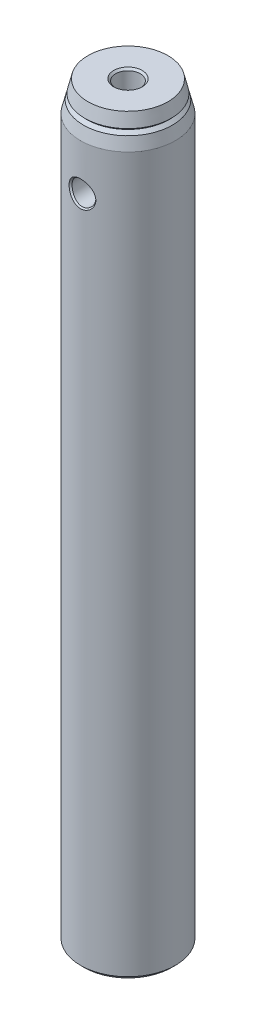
ISO-10303-21;
HEADER;
FILE_DESCRIPTION(('STEP AP214'),'2;1');
FILE_NAME('part.step','',(''),(''),'','','');
FILE_SCHEMA(('AUTOMOTIVE_DESIGN { 1 0 10303 214 1 1 1 1 }'));
ENDSEC;
DATA;
#1=APPLICATION_CONTEXT('core data for automotive mechanical design processes');
#2=APPLICATION_PROTOCOL_DEFINITION('international standard','automotive_design',2000,#1);
#3=PRODUCT_CONTEXT('',#1,'mechanical');
#4=PRODUCT('Part','Part','',(#3));
#5=PRODUCT_RELATED_PRODUCT_CATEGORY('part','',(#4));
#6=PRODUCT_DEFINITION_FORMATION('','',#4);
#7=PRODUCT_DEFINITION_CONTEXT('part definition',#1,'design');
#8=PRODUCT_DEFINITION('design','',#6,#7);
#9=PRODUCT_DEFINITION_SHAPE('','',#8);
#10=(LENGTH_UNIT() NAMED_UNIT(*) SI_UNIT(.MILLI.,.METRE.));
#11=(NAMED_UNIT(*) PLANE_ANGLE_UNIT() SI_UNIT($,.RADIAN.));
#12=(NAMED_UNIT(*) SI_UNIT($,.STERADIAN.) SOLID_ANGLE_UNIT());
#13=UNCERTAINTY_MEASURE_WITH_UNIT(LENGTH_MEASURE(1.E-05),#10,'distance_accuracy_value','');
#14=(GEOMETRIC_REPRESENTATION_CONTEXT(3) GLOBAL_UNCERTAINTY_ASSIGNED_CONTEXT((#13)) GLOBAL_UNIT_ASSIGNED_CONTEXT((#10,
#11,#12)) REPRESENTATION_CONTEXT('',''));
#15=CARTESIAN_POINT('',(0.,0.,0.));
#16=DIRECTION('',(0.,0.,1.));
#17=DIRECTION('',(1.,0.,0.));
#18=AXIS2_PLACEMENT_3D('',#15,#16,#17);
#19=CARTESIAN_POINT('',(0.,99.9998,0.));
#20=DIRECTION('',(0.,-1.,0.));
#21=DIRECTION('',(0.,0.,-1.));
#22=AXIS2_PLACEMENT_3D('',#19,#20,#21);
#23=PLANE('',#22);
#24=CARTESIAN_POINT('',(0.,99.9998,0.));
#25=DIRECTION('',(0.,-1.,0.));
#26=DIRECTION('',(0.,0.,-1.));
#27=AXIS2_PLACEMENT_3D('',#24,#25,#26);
#28=CIRCLE('',#27,1.904);
#29=CARTESIAN_POINT('',(0.,99.9998,-1.904));
#30=VERTEX_POINT('',#29);
#31=EDGE_CURVE('E11',#30,#30,#28,.T.);
#32=ORIENTED_EDGE('',*,*,#31,.T.);
#33=EDGE_LOOP('',(#32));
#34=FACE_BOUND('',#33,.T.);
#35=CARTESIAN_POINT('',(0.,99.9998,0.));
#36=DIRECTION('',(0.,1.,0.));
#37=DIRECTION('',(0.,0.,1.));
#38=AXIS2_PLACEMENT_3D('',#35,#36,#37);
#39=CIRCLE('',#38,5.34669999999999);
#40=CARTESIAN_POINT('',(0.,99.9998,5.34669999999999));
#41=VERTEX_POINT('',#40);
#42=EDGE_CURVE('E64',#41,#41,#39,.T.);
#43=ORIENTED_EDGE('',*,*,#42,.T.);
#44=EDGE_LOOP('',(#43));
#45=FACE_BOUND('',#44,.T.);
#46=ADVANCED_FACE('F17',(#34,#45),#23,.F.);
#47=CARTESIAN_POINT('',(0.,98.2894909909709,0.));
#48=DIRECTION('',(0.,-1.,0.));
#49=DIRECTION('',(0.,0.,-1.));
#50=AXIS2_PLACEMENT_3D('',#47,#48,#49);
#51=CONICAL_SURFACE('',#50,5.76886488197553,0.241998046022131);
#52=ORIENTED_EDGE('',*,*,#42,.F.);
#53=EDGE_LOOP('',(#52));
#54=FACE_BOUND('',#53,.T.);
#55=CARTESIAN_POINT('',(0.,98.2894909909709,0.));
#56=DIRECTION('',(0.,1.,0.));
#57=DIRECTION('',(0.,0.,1.));
#58=AXIS2_PLACEMENT_3D('',#55,#56,#57);
#59=CIRCLE('',#58,5.76886488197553);
#60=CARTESIAN_POINT('',(0.,98.2894909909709,5.76886488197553));
#61=VERTEX_POINT('',#60);
#62=EDGE_CURVE('E61',#61,#61,#59,.T.);
#63=ORIENTED_EDGE('',*,*,#62,.T.);
#64=EDGE_LOOP('',(#63));
#65=FACE_BOUND('',#64,.T.);
#66=ADVANCED_FACE('F216',(#54,#65),#51,.T.);
#67=CARTESIAN_POINT('',(0.,98.00082,0.));
#68=DIRECTION('',(0.,1.,0.));
#69=DIRECTION('',(0.,0.,1.));
#70=AXIS2_PLACEMENT_3D('',#67,#68,#69);
#71=CONICAL_SURFACE('',#70,5.49909999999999,0.751555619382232);
#72=ORIENTED_EDGE('',*,*,#62,.F.);
#73=EDGE_LOOP('',(#72));
#74=FACE_BOUND('',#73,.T.);
#75=CARTESIAN_POINT('',(0.,98.00082,0.));
#76=DIRECTION('',(0.,1.,0.));
#77=DIRECTION('',(0.,0.,1.));
#78=AXIS2_PLACEMENT_3D('',#75,#76,#77);
#79=CIRCLE('',#78,5.49909999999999);
#80=CARTESIAN_POINT('',(0.,98.00082,5.49909999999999));
#81=VERTEX_POINT('',#80);
#82=EDGE_CURVE('E58',#81,#81,#79,.T.);
#83=ORIENTED_EDGE('',*,*,#82,.T.);
#84=EDGE_LOOP('',(#83));
#85=FACE_BOUND('',#84,.T.);
#86=ADVANCED_FACE('F223',(#74,#85),#71,.T.);
#87=CARTESIAN_POINT('',(0.,97.5865839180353,0.));
#88=DIRECTION('',(0.,-1.,0.));
#89=DIRECTION('',(0.,0.,-1.));
#90=AXIS2_PLACEMENT_3D('',#87,#88,#89);
#91=CONICAL_SURFACE('',#90,5.94236726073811,0.819240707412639);
#92=ORIENTED_EDGE('',*,*,#82,.F.);
#93=EDGE_LOOP('',(#92));
#94=FACE_BOUND('',#93,.T.);
#95=CARTESIAN_POINT('',(0.,97.5865839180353,0.));
#96=DIRECTION('',(0.,1.,0.));
#97=DIRECTION('',(0.,0.,1.));
#98=AXIS2_PLACEMENT_3D('',#95,#96,#97);
#99=CIRCLE('',#98,5.94236726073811);
#100=CARTESIAN_POINT('',(0.,97.5865839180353,5.94236726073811));
#101=VERTEX_POINT('',#100);
#102=EDGE_CURVE('E55',#101,#101,#99,.T.);
#103=ORIENTED_EDGE('',*,*,#102,.T.);
#104=EDGE_LOOP('',(#103));
#105=FACE_BOUND('',#104,.T.);
#106=ADVANCED_FACE('F232',(#94,#105),#91,.T.);
#107=CARTESIAN_POINT('',(0.,95.9866,0.));
#108=DIRECTION('',(0.,-1.,0.));
#109=DIRECTION('',(0.,0.,-1.));
#110=AXIS2_PLACEMENT_3D('',#107,#108,#109);
#111=CONICAL_SURFACE('',#110,6.33729999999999,0.241998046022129);
#112=ORIENTED_EDGE('',*,*,#102,.F.);
#113=EDGE_LOOP('',(#112));
#114=FACE_BOUND('',#113,.T.);
#115=CARTESIAN_POINT('',(0.,95.9866,0.));
#116=DIRECTION('',(0.,1.,0.));
#117=DIRECTION('',(0.,0.,1.));
#118=AXIS2_PLACEMENT_3D('',#115,#116,#117);
#119=CIRCLE('',#118,6.33729999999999);
#120=CARTESIAN_POINT('',(0.,95.9866,6.33729999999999));
#121=VERTEX_POINT('',#120);
#122=EDGE_CURVE('E52',#121,#121,#119,.T.);
#123=ORIENTED_EDGE('',*,*,#122,.T.);
#124=EDGE_LOOP('',(#123));
#125=FACE_BOUND('',#124,.T.);
#126=ADVANCED_FACE('F89',(#114,#125),#111,.T.);
#127=CARTESIAN_POINT('',(0.,99.9998,0.));
#128=DIRECTION('',(0.,1.,0.));
#129=DIRECTION('',(0.,0.,1.));
#130=AXIS2_PLACEMENT_3D('',#127,#128,#129);
#131=CYLINDRICAL_SURFACE('',#130,6.33729999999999);
#132=CARTESIAN_POINT('',(0.,88.1117517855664,6.3373));
#133=CARTESIAN_POINT('',(0.0294399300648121,88.1117358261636,6.33730404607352));
#134=CARTESIAN_POINT('',(0.0588789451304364,88.1124541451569,6.33707764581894));
#135=CARTESIAN_POINT('',(0.117621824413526,88.1153349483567,6.33618719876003));
#136=CARTESIAN_POINT('',(0.146925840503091,88.1174945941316,6.33552401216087));
#137=CARTESIAN_POINT('',(0.205337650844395,88.1232294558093,6.33378438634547));
#138=CARTESIAN_POINT('',(0.234445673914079,88.1268025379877,6.33270857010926));
#139=CARTESIAN_POINT('',(0.292405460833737,88.1353350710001,6.33016829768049));
#140=CARTESIAN_POINT('',(0.321257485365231,88.1402928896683,6.32870429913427));
#141=CARTESIAN_POINT('',(0.378645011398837,88.1515661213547,6.32541212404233));
#142=CARTESIAN_POINT('',(0.407180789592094,88.1578802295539,6.32358429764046));
#143=CARTESIAN_POINT('',(0.463875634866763,88.1718373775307,6.31958889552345));
#144=CARTESIAN_POINT('',(0.492034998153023,88.1794792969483,6.31742160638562));
#145=CARTESIAN_POINT('',(0.547916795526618,88.1960635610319,6.31277166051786));
#146=CARTESIAN_POINT('',(0.575639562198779,88.2050048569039,6.31028925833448));
#147=CARTESIAN_POINT('',(0.630587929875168,88.2241594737,6.30503343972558));
#148=CARTESIAN_POINT('',(0.657813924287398,88.2343717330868,6.30226026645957));
#149=CARTESIAN_POINT('',(0.711708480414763,88.2560399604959,6.29644724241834));
#150=CARTESIAN_POINT('',(0.738377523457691,88.2674947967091,6.29340763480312));
#151=CARTESIAN_POINT('',(0.7910978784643,88.2916199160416,6.2870860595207));
#152=CARTESIAN_POINT('',(0.817149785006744,88.3042889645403,6.28380433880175));
#153=CARTESIAN_POINT('',(0.868575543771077,88.3308142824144,6.27702288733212));
#154=CARTESIAN_POINT('',(0.893950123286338,88.3446692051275,6.27352340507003));
#155=CARTESIAN_POINT('',(0.943960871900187,88.3735380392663,6.26633065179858));
#156=CARTESIAN_POINT('',(0.968597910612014,88.3885505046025,6.26263762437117));
#157=CARTESIAN_POINT('',(1.01707325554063,88.4197062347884,6.25508249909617));
#158=CARTESIAN_POINT('',(1.04091256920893,88.4358479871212,6.25122062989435));
#159=CARTESIAN_POINT('',(1.08773198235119,88.4692338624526,6.24335072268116));
#160=CARTESIAN_POINT('',(1.11071320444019,88.4864764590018,6.23934289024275));
#161=CARTESIAN_POINT('',(1.15575658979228,88.5220363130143,6.23121076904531));
#162=CARTESIAN_POINT('',(1.17781994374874,88.5403520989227,6.22708664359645));
#163=CARTESIAN_POINT('',(1.22096551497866,88.5780276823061,6.2187263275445));
#164=CARTESIAN_POINT('',(1.24204891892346,88.5973861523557,6.21449028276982));
#165=CARTESIAN_POINT('',(1.28317150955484,88.6371178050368,6.20600685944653));
#166=CARTESIAN_POINT('',(1.30321223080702,88.6574894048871,6.20175950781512));
#167=CARTESIAN_POINT('',(1.34221596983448,88.6991882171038,6.19335716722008));
#168=CARTESIAN_POINT('',(1.36118083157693,88.7205136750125,6.18920202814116));
#169=CARTESIAN_POINT('',(1.39800144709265,88.7640588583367,6.18099132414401));
#170=CARTESIAN_POINT('',(1.41585895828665,88.7862770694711,6.17693560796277));
#171=CARTESIAN_POINT('',(1.45043566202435,88.8315493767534,6.16895620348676));
#172=CARTESIAN_POINT('',(1.46715657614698,88.854602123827,6.16503232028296));
#173=CARTESIAN_POINT('',(1.49943021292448,88.901484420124,6.15734229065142));
#174=CARTESIAN_POINT('',(1.51498466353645,88.925312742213,6.15357591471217));
#175=CARTESIAN_POINT('',(1.54489561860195,88.9736873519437,6.14622841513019));
#176=CARTESIAN_POINT('',(1.55925388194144,88.9982325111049,6.14264702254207));
#177=CARTESIAN_POINT('',(1.58674263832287,89.0479819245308,6.13569652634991));
#178=CARTESIAN_POINT('',(1.59987492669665,89.0731851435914,6.13232711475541));
#179=CARTESIAN_POINT('',(1.62488191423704,89.1241918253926,6.12582774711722));
#180=CARTESIAN_POINT('',(1.6367584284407,89.1499943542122,6.12269744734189));
#181=CARTESIAN_POINT('',(1.65922406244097,89.2021407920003,6.11670343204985));
#182=CARTESIAN_POINT('',(1.66981497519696,89.228483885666,6.1138393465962));
#183=CARTESIAN_POINT('',(1.6896796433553,89.2816525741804,6.10840488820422));
#184=CARTESIAN_POINT('',(1.69895509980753,89.3084774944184,6.10583413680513));
#185=CARTESIAN_POINT('',(1.71615916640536,89.3625509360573,6.10101345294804));
#186=CARTESIAN_POINT('',(1.72408928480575,89.3897989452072,6.09876316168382));
#187=CARTESIAN_POINT('',(1.73857307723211,89.4446596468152,6.09461047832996));
#188=CARTESIAN_POINT('',(1.74512793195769,89.4722720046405,6.0927077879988));
#189=CARTESIAN_POINT('',(1.75683178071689,89.527802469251,6.08927733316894));
#190=CARTESIAN_POINT('',(1.76198145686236,89.5557204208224,6.08774938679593));
#191=CARTESIAN_POINT('',(1.77084554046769,89.6118031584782,6.08509542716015));
#192=CARTESIAN_POINT('',(1.77455992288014,89.6399679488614,6.0839694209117));
#193=CARTESIAN_POINT('',(1.78052484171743,89.6964854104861,6.0821461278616));
#194=CARTESIAN_POINT('',(1.78277440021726,89.7248381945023,6.08144912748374));
#195=CARTESIAN_POINT('',(1.78577903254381,89.7816729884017,6.08051108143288));
#196=CARTESIAN_POINT('',(1.78653189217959,89.8101551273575,6.08027071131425));
#197=CARTESIAN_POINT('',(1.78652142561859,89.8671195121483,6.08027101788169));
#198=CARTESIAN_POINT('',(1.78575806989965,89.8956017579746,6.0805117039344));
#199=CARTESIAN_POINT('',(1.78274505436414,89.9524377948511,6.08144750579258));
#200=CARTESIAN_POINT('',(1.78049756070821,89.9807917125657,6.08214195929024));
#201=CARTESIAN_POINT('',(1.77454464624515,90.0373128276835,6.08395846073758));
#202=CARTESIAN_POINT('',(1.77084019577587,90.0654801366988,6.08508022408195));
#203=CARTESIAN_POINT('',(1.76200373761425,90.1215697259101,6.08772409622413));
#204=CARTESIAN_POINT('',(1.75687176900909,90.1494920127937,6.08924619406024));
#205=CARTESIAN_POINT('',(1.74520976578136,90.2050333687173,6.0926637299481));
#206=CARTESIAN_POINT('',(1.73867907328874,90.2326522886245,6.09455934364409));
#207=CARTESIAN_POINT('',(1.72424904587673,90.287528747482,6.09869695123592));
#208=CARTESIAN_POINT('',(1.71634855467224,90.3147859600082,6.10093923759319));
#209=CARTESIAN_POINT('',(1.69920811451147,90.3688808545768,6.10574330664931));
#210=CARTESIAN_POINT('',(1.68996667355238,90.3957180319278,6.10830544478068));
#211=CARTESIAN_POINT('',(1.67017337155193,90.4489146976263,6.11372238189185));
#212=CARTESIAN_POINT('',(1.65961981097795,90.4752735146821,6.1165775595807));
#213=CARTESIAN_POINT('',(1.63723117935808,90.5274552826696,6.12255377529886));
#214=CARTESIAN_POINT('',(1.62539429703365,90.5532774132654,6.12567518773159));
#215=CARTESIAN_POINT('',(1.60046784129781,90.6043276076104,6.13215710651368));
#216=CARTESIAN_POINT('',(1.58737641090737,90.6295547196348,6.13551796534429));
#217=CARTESIAN_POINT('',(1.55996960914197,90.6793566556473,6.14245199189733));
#218=CARTESIAN_POINT('',(1.54565237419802,90.7039304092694,6.14602548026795));
#219=CARTESIAN_POINT('',(1.51582269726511,90.7523673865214,6.15335811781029));
#220=CARTESIAN_POINT('',(1.50030840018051,90.7762294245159,6.15711755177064));
#221=CARTESIAN_POINT('',(1.46811324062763,90.8231847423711,6.16479495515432));
#222=CARTESIAN_POINT('',(1.45143052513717,90.8462767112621,6.1687131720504));
#223=CARTESIAN_POINT('',(1.41692747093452,90.8916336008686,6.17668281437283));
#224=CARTESIAN_POINT('',(1.39910525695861,90.913897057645,6.18073445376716));
#225=CARTESIAN_POINT('',(1.36235107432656,90.9575389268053,6.18893888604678));
#226=CARTESIAN_POINT('',(1.34341716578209,90.9789156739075,6.19309184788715));
#227=CARTESIAN_POINT('',(1.30447161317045,91.0207251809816,6.20149204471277));
#228=CARTESIAN_POINT('',(1.28445791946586,91.0411559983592,6.20573944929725));
#229=CARTESIAN_POINT('',(1.2433825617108,91.0810058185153,6.21422472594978));
#230=CARTESIAN_POINT('',(1.22231929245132,91.100423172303,6.21846257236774));
#231=CARTESIAN_POINT('',(1.17920582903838,91.1382077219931,6.22682733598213));
#232=CARTESIAN_POINT('',(1.15715450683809,91.1565736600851,6.23095411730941));
#233=CARTESIAN_POINT('',(1.11212941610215,91.1922272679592,6.23909234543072));
#234=CARTESIAN_POINT('',(1.08915449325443,91.2095135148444,6.2431036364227));
#235=CARTESIAN_POINT('',(1.04234247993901,91.2429804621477,6.25098116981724));
#236=CARTESIAN_POINT('',(1.01850428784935,91.2591596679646,6.25484721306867));
#237=CARTESIAN_POINT('',(0.970027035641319,91.2903849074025,6.26241131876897));
#238=CARTESIAN_POINT('',(0.945386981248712,91.3054294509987,6.26610915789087));
#239=CARTESIAN_POINT('',(0.895366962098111,91.3343577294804,6.27331208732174));
#240=CARTESIAN_POINT('',(0.869986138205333,91.3482400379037,6.27681693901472));
#241=CARTESIAN_POINT('',(0.818545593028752,91.374816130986,6.28360960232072));
#242=CARTESIAN_POINT('',(0.792485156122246,91.3875085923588,6.2868971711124));
#243=CARTESIAN_POINT('',(0.73974637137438,91.4116772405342,6.29323083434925));
#244=CARTESIAN_POINT('',(0.713067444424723,91.4231522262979,6.29627668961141));
#245=CARTESIAN_POINT('',(0.659152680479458,91.4448581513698,6.30210251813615));
#246=CARTESIAN_POINT('',(0.631916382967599,91.4550880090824,6.30488225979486));
#247=CARTESIAN_POINT('',(0.576947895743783,91.4742759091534,6.31015143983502));
#248=CARTESIAN_POINT('',(0.549215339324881,91.4832329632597,6.31264065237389));
#249=CARTESIAN_POINT('',(0.493315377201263,91.4998475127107,6.31730435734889));
#250=CARTESIAN_POINT('',(0.465147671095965,91.5075040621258,6.31947862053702));
#251=CARTESIAN_POINT('',(0.408438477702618,91.5214899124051,6.32348801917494));
#252=CARTESIAN_POINT('',(0.379896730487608,91.5278182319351,6.32532290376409));
#253=CARTESIAN_POINT('',(0.322500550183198,91.5391200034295,6.32862915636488));
#254=CARTESIAN_POINT('',(0.293645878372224,91.5440923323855,6.33010022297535));
#255=CARTESIAN_POINT('',(0.235684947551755,91.5526546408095,6.33265448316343));
#256=CARTESIAN_POINT('',(0.206578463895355,91.5562432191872,6.33373728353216));
#257=CARTESIAN_POINT('',(0.148175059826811,91.5620105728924,6.33549068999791));
#258=CARTESIAN_POINT('',(0.118877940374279,91.5641875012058,6.33616075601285));
#259=CARTESIAN_POINT('',(0.0601542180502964,91.5671046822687,6.33706445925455));
#260=CARTESIAN_POINT('',(0.0307274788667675,91.5678424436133,6.33729733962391));
#261=CARTESIAN_POINT('',(-0.0281314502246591,91.5678530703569,6.33730239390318));
#262=CARTESIAN_POINT('',(-0.0575636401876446,91.5671256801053,6.33707448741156));
#263=CARTESIAN_POINT('',(-0.116308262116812,91.564227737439,6.33618067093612));
#264=CARTESIAN_POINT('',(-0.145620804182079,91.5620592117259,6.33551537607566));
#265=CARTESIAN_POINT('',(-0.204063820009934,91.5563082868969,6.33377147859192));
#266=CARTESIAN_POINT('',(-0.233194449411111,91.5527273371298,6.33269329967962));
#267=CARTESIAN_POINT('',(-0.291211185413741,91.5441801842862,6.33014820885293));
#268=CARTESIAN_POINT('',(-0.320097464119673,91.5392150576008,6.32868159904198));
#269=CARTESIAN_POINT('',(-0.377563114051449,91.5279280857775,6.32538416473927));
#270=CARTESIAN_POINT('',(-0.406142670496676,91.5216071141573,6.32355357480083));
#271=CARTESIAN_POINT('',(-0.462932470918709,91.5076367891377,6.31955264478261));
#272=CARTESIAN_POINT('',(-0.491142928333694,91.499988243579,6.31738251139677));
#273=CARTESIAN_POINT('',(-0.547132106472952,91.4833909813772,6.31272692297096));
#274=CARTESIAN_POINT('',(-0.574911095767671,91.4744431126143,6.31024167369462));
#275=CARTESIAN_POINT('',(-0.629974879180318,91.4552753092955,6.30498025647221));
#276=CARTESIAN_POINT('',(-0.657260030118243,91.4450563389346,6.30220430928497));
#277=CARTESIAN_POINT('',(-0.711273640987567,91.4233743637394,6.29638588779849));
#278=CARTESIAN_POINT('',(-0.738002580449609,91.41191248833,6.29334365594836));
#279=CARTESIAN_POINT('',(-0.790841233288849,91.3877726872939,6.28701704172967));
#280=CARTESIAN_POINT('',(-0.816951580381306,91.3750960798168,6.28373292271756));
#281=CARTESIAN_POINT('',(-0.8684904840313,91.348554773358,6.2769469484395));
#282=CARTESIAN_POINT('',(-0.893919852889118,91.3346915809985,6.27344537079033));
#283=CARTESIAN_POINT('',(-0.944034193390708,91.3058050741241,6.26624876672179));
#284=CARTESIAN_POINT('',(-0.968720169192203,91.2907834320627,6.26255402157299));
#285=CARTESIAN_POINT('',(-1.0172851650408,91.2596079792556,6.2549958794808));
#286=CARTESIAN_POINT('',(-1.04116537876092,91.243455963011,6.25113275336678));
#287=CARTESIAN_POINT('',(-1.08805606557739,91.2100479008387,6.24326080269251));
#288=CARTESIAN_POINT('',(-1.11106789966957,91.1927937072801,6.23925222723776));
#289=CARTESIAN_POINT('',(-1.15615992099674,91.1572089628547,6.23111925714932));
#290=CARTESIAN_POINT('',(-1.17824158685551,91.138880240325,6.2269950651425));
#291=CARTESIAN_POINT('',(-1.22140823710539,91.1011761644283,6.21863501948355));
#292=CARTESIAN_POINT('',(-1.2424947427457,91.081802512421,6.21439935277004));
#293=CARTESIAN_POINT('',(-1.28361269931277,91.0420361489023,6.2059174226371));
#294=CARTESIAN_POINT('',(-1.30364583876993,91.0216451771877,6.20167118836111));
#295=CARTESIAN_POINT('',(-1.34263154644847,90.9799033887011,6.193271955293));
#296=CARTESIAN_POINT('',(-1.3615858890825,90.9585542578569,6.18911881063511));
#297=CARTESIAN_POINT('',(-1.39838257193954,90.9149579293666,6.18091254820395));
#298=CARTESIAN_POINT('',(-1.41622659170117,90.8927121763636,6.17685928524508));
#299=CARTESIAN_POINT('',(-1.4507743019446,90.8473822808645,6.16888519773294));
#300=CARTESIAN_POINT('',(-1.46747963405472,90.8242994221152,6.16496418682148));
#301=CARTESIAN_POINT('',(-1.49972072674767,90.7773554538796,6.15728016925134));
#302=CARTESIAN_POINT('',(-1.51525814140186,90.7534955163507,6.15351694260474));
#303=CARTESIAN_POINT('',(-1.54513433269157,90.7050573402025,6.14617589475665));
#304=CARTESIAN_POINT('',(-1.55947480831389,90.6804801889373,6.14259781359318));
#305=CARTESIAN_POINT('',(-1.58692795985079,90.6306675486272,6.13565397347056));
#306=CARTESIAN_POINT('',(-1.60004239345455,90.6054330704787,6.13228791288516));
#307=CARTESIAN_POINT('',(-1.62501430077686,90.5543657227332,6.12579516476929));
#308=CARTESIAN_POINT('',(-1.63687358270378,90.5285337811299,6.12266813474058));
#309=CARTESIAN_POINT('',(-1.65930603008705,90.4763314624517,6.11668046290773));
#310=CARTESIAN_POINT('',(-1.66988102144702,90.4499619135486,6.11381944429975));
#311=CARTESIAN_POINT('',(-1.68971576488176,90.3967443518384,6.10839081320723));
#312=CARTESIAN_POINT('',(-1.69897730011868,90.3698970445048,6.10582280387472));
#313=CARTESIAN_POINT('',(-1.71615607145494,90.3157839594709,6.10100719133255));
#314=CARTESIAN_POINT('',(-1.72407495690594,90.2885187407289,6.09875919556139));
#315=CARTESIAN_POINT('',(-1.73853945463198,90.2336298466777,6.09461058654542));
#316=CARTESIAN_POINT('',(-1.7450864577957,90.2060065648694,6.09270962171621));
#317=CARTESIAN_POINT('',(-1.75677836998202,90.1504615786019,6.08928200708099));
#318=CARTESIAN_POINT('',(-1.76192425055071,90.1225400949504,6.08775509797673));
#319=CARTESIAN_POINT('',(-1.77078516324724,90.0664587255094,6.08510249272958));
#320=CARTESIAN_POINT('',(-1.7745005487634,90.0382989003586,6.08397669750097));
#321=CARTESIAN_POINT('',(-1.78047228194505,89.9818009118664,6.08215307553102));
#322=CARTESIAN_POINT('',(-1.78272812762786,89.9534626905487,6.0814553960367));
#323=CARTESIAN_POINT('',(-1.78575147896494,89.8966676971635,6.08051493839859));
#324=CARTESIAN_POINT('',(-1.78651735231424,89.8682108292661,6.08027265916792));
#325=CARTESIAN_POINT('',(-1.7865367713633,89.811302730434,6.0802688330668));
#326=CARTESIAN_POINT('',(-1.78579064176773,89.7828514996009,6.08050718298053));
#327=CARTESIAN_POINT('',(-1.78281302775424,89.7260777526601,6.08143863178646));
#328=CARTESIAN_POINT('',(-1.78058377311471,89.6977551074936,6.08213104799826));
#329=CARTESIAN_POINT('',(-1.77466841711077,89.6412967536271,6.08394357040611));
#330=CARTESIAN_POINT('',(-1.77098334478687,89.6131609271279,6.08506337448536));
#331=CARTESIAN_POINT('',(-1.76218590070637,89.5571344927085,6.08770347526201));
#332=CARTESIAN_POINT('',(-1.75707361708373,89.529243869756,6.08922374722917));
#333=CARTESIAN_POINT('',(-1.74545068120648,89.4737659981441,6.09263775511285));
#334=CARTESIAN_POINT('',(-1.73893940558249,89.4461788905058,6.09453165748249));
#335=CARTESIAN_POINT('',(-1.72454728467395,89.3913661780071,6.09866596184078));
#336=CARTESIAN_POINT('',(-1.71666529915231,89.3641408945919,6.10090665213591));
#337=CARTESIAN_POINT('',(-1.69956034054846,89.310109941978,6.10570763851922));
#338=CARTESIAN_POINT('',(-1.69033586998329,89.2833047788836,6.1082682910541));
#339=CARTESIAN_POINT('',(-1.67057437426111,89.2301721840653,6.11368235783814));
#340=CARTESIAN_POINT('',(-1.66003562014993,89.2038454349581,6.11653615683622));
#341=CARTESIAN_POINT('',(-1.63767386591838,89.1517278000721,6.1225097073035));
#342=CARTESIAN_POINT('',(-1.62584899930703,89.1259377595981,6.12562984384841));
#343=CARTESIAN_POINT('',(-1.60094323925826,89.0749516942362,6.13210929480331));
#344=CARTESIAN_POINT('',(-1.58786040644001,89.0497566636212,6.13546897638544));
#345=CARTESIAN_POINT('',(-1.56046686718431,89.000018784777,6.1424007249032));
#346=CARTESIAN_POINT('',(-1.54615418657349,88.9754770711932,6.14597313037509));
#347=CARTESIAN_POINT('',(-1.5163290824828,88.927104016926,6.15330367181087));
#348=CARTESIAN_POINT('',(-1.500814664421,88.9032739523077,6.15706211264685));
#349=CARTESIAN_POINT('',(-1.46861415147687,88.8563823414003,6.16473759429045));
#350=CARTESIAN_POINT('',(-1.4519260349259,88.8333222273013,6.16865490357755));
#351=CARTESIAN_POINT('',(-1.4174063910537,88.7880288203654,6.17662278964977));
#352=CARTESIAN_POINT('',(-1.39957279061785,88.7657971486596,6.18067360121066));
#353=CARTESIAN_POINT('',(-1.3627897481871,88.7222182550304,6.18887643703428));
#354=CARTESIAN_POINT('',(-1.34383814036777,88.700872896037,6.19302864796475));
#355=CARTESIAN_POINT('',(-1.30484939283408,88.6591266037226,6.20142739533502));
#356=CARTESIAN_POINT('',(-1.28480994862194,88.6387278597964,6.20567411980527));
#357=CARTESIAN_POINT('',(-1.24367802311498,88.5989375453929,6.21415825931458));
#358=CARTESIAN_POINT('',(-1.22258362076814,88.5795479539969,6.21839564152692));
#359=CARTESIAN_POINT('',(-1.17940611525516,88.5418093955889,6.22675999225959));
#360=CARTESIAN_POINT('',(-1.15732157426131,88.5234620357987,6.23088678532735));
#361=CARTESIAN_POINT('',(-1.11222765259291,88.4878380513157,6.23902550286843));
#362=CARTESIAN_POINT('',(-1.08921687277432,88.4705631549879,6.24303723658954));
#363=CARTESIAN_POINT('',(-1.0423315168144,88.4371119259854,6.25091606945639));
#364=CARTESIAN_POINT('',(-1.01845565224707,88.4209373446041,6.25478293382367));
#365=CARTESIAN_POINT('',(-0.969901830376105,88.3897153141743,6.26234904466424));
#366=CARTESIAN_POINT('',(-0.945222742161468,88.3746695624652,6.26604803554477));
#367=CARTESIAN_POINT('',(-0.895123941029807,88.3457336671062,6.27325357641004));
#368=CARTESIAN_POINT('',(-0.869703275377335,88.3318451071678,6.27675986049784));
#369=CARTESIAN_POINT('',(-0.818182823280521,88.3052521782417,6.28355564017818));
#370=CARTESIAN_POINT('',(-0.792082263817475,88.2925492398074,6.286844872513));
#371=CARTESIAN_POINT('',(-0.739263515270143,88.2683561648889,6.29318205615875));
#372=CARTESIAN_POINT('',(-0.712544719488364,88.2568672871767,6.29622975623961));
#373=CARTESIAN_POINT('',(-0.658551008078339,88.2351309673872,6.30205940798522));
#374=CARTESIAN_POINT('',(-0.631275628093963,88.2248846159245,6.30484112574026));
#375=CARTESIAN_POINT('',(-0.576230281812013,88.205661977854,6.31011433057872));
#376=CARTESIAN_POINT('',(-0.548459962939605,88.1966866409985,6.31260560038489));
#377=CARTESIAN_POINT('',(-0.492486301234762,88.1800346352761,6.31727343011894));
#378=CARTESIAN_POINT('',(-0.464282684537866,88.1723588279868,6.31944978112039));
#379=CARTESIAN_POINT('',(-0.407504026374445,88.1583344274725,6.32346330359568));
#380=CARTESIAN_POINT('',(-0.378928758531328,88.1519866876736,6.32530025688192));
#381=CARTESIAN_POINT('',(-0.321468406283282,88.1406469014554,6.32861052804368));
#382=CARTESIAN_POINT('',(-0.292583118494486,88.1356558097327,6.3300835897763));
#383=CARTESIAN_POINT('',(-0.234564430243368,88.1270576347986,6.33264167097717));
#384=CARTESIAN_POINT('',(-0.205430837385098,88.1234517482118,6.33372635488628));
#385=CARTESIAN_POINT('',(-0.146976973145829,88.1176523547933,6.335483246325));
#386=CARTESIAN_POINT('',(-0.117656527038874,88.1154604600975,6.33615498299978));
#387=CARTESIAN_POINT('',(-0.0588914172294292,88.1125165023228,6.33706186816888));
#388=CARTESIAN_POINT('',(-0.0294466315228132,88.1117666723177,6.33729633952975));
#389=CARTESIAN_POINT('',(0.,88.1117517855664,6.3373));
#390=B_SPLINE_CURVE_WITH_KNOTS('',3,(#132,#133,#134,#135,#136,#137,#138,#139,#140,#141,#142,
#143,#144,#145,#146,#147,#148,#149,#150,#151,#152,#153,#154,#155,#156,#157,#158,#159,#160,#161,
#162,#163,#164,#165,#166,#167,#168,#169,#170,#171,#172,#173,#174,#175,#176,#177,#178,#179,#180,
#181,#182,#183,#184,#185,#186,#187,#188,#189,#190,#191,#192,#193,#194,#195,#196,#197,#198,#199,
#200,#201,#202,#203,#204,#205,#206,#207,#208,#209,#210,#211,#212,#213,#214,#215,#216,#217,#218,
#219,#220,#221,#222,#223,#224,#225,#226,#227,#228,#229,#230,#231,#232,#233,#234,#235,#236,#237,
#238,#239,#240,#241,#242,#243,#244,#245,#246,#247,#248,#249,#250,#251,#252,#253,#254,#255,#256,
#257,#258,#259,#260,#261,#262,#263,#264,#265,#266,#267,#268,#269,#270,#271,#272,#273,#274,#275,
#276,#277,#278,#279,#280,#281,#282,#283,#284,#285,#286,#287,#288,#289,#290,#291,#292,#293,#294,
#295,#296,#297,#298,#299,#300,#301,#302,#303,#304,#305,#306,#307,#308,#309,#310,#311,#312,#313,
#314,#315,#316,#317,#318,#319,#320,#321,#322,#323,#324,#325,#326,#327,#328,#329,#330,#331,#332,
#333,#334,#335,#336,#337,#338,#339,#340,#341,#342,#343,#344,#345,#346,#347,#348,#349,#350,#351,
#352,#353,#354,#355,#356,#357,#358,#359,#360,#361,#362,#363,#364,#365,#366,#367,#368,#369,#370,
#371,#372,#373,#374,#375,#376,#377,#378,#379,#380,#381,#382,#383,#384,#385,#386,#387,#388,#389),
.UNSPECIFIED.,.F.,.F.,(4,2,2,2,2,2,2,2,2,2,2,2,2,2,2,2,2,2,2,2,2,2,2,2,2,2,2,2,2,2,2,2,2,2,2,2,
2,2,2,2,2,2,2,2,2,2,2,2,2,2,2,2,2,2,2,2,2,2,2,2,2,2,2,2,2,2,2,2,2,2,2,2,2,2,2,2,2,2,2,2,2,2,2,2,
2,2,2,2,2,2,2,2,2,2,2,2,2,2,2,2,2,2,2,2,2,2,2,2,2,2,2,2,2,2,2,2,2,2,2,2,2,2,2,2,2,2,2,2,4),(0.,
0.0883078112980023,0.176442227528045,0.264444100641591,0.352342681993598,0.440157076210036,
0.527897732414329,0.61556795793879,0.703165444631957,0.790683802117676,0.878114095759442,
0.965446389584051,1.05267129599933,1.13978153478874,1.22677350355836,1.31364886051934,
1.40041611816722,1.48705183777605,1.57353427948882,1.65987575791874,1.74608340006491,
1.83216070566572,1.91810912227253,2.00392963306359,2.08962435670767,2.17519815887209,
2.26066027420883,2.34602593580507,2.43131800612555,2.51656859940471,2.60182068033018,
2.68712961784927,2.77256466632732,2.85800137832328,2.94331366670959,3.02856923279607,
3.11382246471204,3.19911588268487,3.28448165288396,3.36994314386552,3.45551650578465,
3.54121225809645,3.62703687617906,3.71299437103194,3.79908785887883,3.88532111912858,
3.97170013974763,4.0582346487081,4.14493962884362,4.23178154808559,4.31872527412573,
4.40578126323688,4.49295255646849,4.58023639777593,4.66762584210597,4.75511135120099,
4.84268237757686,4.930328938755,5.01804318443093,5.10582095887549,5.19366335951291,
5.28157829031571,5.36958200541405,5.45770063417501,5.54597167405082,5.63425811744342,
5.72242066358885,5.81049297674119,5.89849699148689,5.98644447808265,6.07433863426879,
6.16217569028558,6.24994651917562,6.33763824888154,6.4252358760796,6.51272388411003,
6.60008786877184,6.68731617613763,6.77440155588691,6.86134283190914,6.94814658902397,
7.03480667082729,7.12131982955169,7.20769877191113,7.29395042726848,7.38007753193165,
7.46608022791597,7.55195767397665,7.63770966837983,7.72333828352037,7.80884951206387,
7.89425492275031,7.97957332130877,8.06483240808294,8.1500704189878,8.2353377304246,
8.32069840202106,8.40604074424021,8.49125506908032,8.5764092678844,8.66155820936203,
8.74674517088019,8.83200333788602,8.91735734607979,9.00282484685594,9.08841808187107,
9.17414545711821,9.2600131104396,9.34602646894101,9.43219179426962,9.51851771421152,
9.60501673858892,9.69170675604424,9.77856083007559,9.86554539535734,9.95266668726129,
10.039923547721,10.127309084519,10.2148123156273,10.3024197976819,10.3901172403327,
10.477891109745,10.5657302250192,10.6536273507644,10.7415807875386,10.8295959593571,
10.9176869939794,11.005878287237,11.0942060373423),.UNSPECIFIED.);
#391=CARTESIAN_POINT('',(0.,88.1117517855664,6.3373));
#392=VERTEX_POINT('',#391);
#393=EDGE_CURVE('E135',#392,#392,#390,.F.);
#394=ORIENTED_EDGE('',*,*,#393,.T.);
#395=EDGE_LOOP('',(#394));
#396=FACE_BOUND('',#395,.T.);
#397=CARTESIAN_POINT('',(0.,91.5678482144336,-6.3373));
#398=CARTESIAN_POINT('',(0.0294399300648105,91.5678641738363,-6.33730404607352));
#399=CARTESIAN_POINT('',(0.0588789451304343,91.5671458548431,-6.33707764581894));
#400=CARTESIAN_POINT('',(0.117621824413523,91.5642650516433,-6.33618719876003));
#401=CARTESIAN_POINT('',(0.146925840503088,91.5621054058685,-6.33552401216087));
#402=CARTESIAN_POINT('',(0.205337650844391,91.5563705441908,-6.33378438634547));
#403=CARTESIAN_POINT('',(0.234445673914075,91.5527974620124,-6.33270857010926));
#404=CARTESIAN_POINT('',(0.292405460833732,91.5442649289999,-6.33016829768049));
#405=CARTESIAN_POINT('',(0.321257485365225,91.5393071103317,-6.32870429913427));
#406=CARTESIAN_POINT('',(0.378645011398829,91.5280338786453,-6.32541212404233));
#407=CARTESIAN_POINT('',(0.407180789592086,91.5217197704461,-6.32358429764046));
#408=CARTESIAN_POINT('',(0.463875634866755,91.5077626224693,-6.31958889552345));
#409=CARTESIAN_POINT('',(0.492034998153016,91.5001207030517,-6.31742160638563));
#410=CARTESIAN_POINT('',(0.547916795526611,91.483536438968,-6.31277166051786));
#411=CARTESIAN_POINT('',(0.575639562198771,91.4745951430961,-6.31028925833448));
#412=CARTESIAN_POINT('',(0.63058792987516,91.4554405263,-6.30503343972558));
#413=CARTESIAN_POINT('',(0.657813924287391,91.4452282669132,-6.30226026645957));
#414=CARTESIAN_POINT('',(0.711708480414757,91.4235600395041,-6.29644724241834));
#415=CARTESIAN_POINT('',(0.738377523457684,91.4121052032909,-6.29340763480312));
#416=CARTESIAN_POINT('',(0.791097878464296,91.3879800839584,-6.2870860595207));
#417=CARTESIAN_POINT('',(0.817149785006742,91.3753110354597,-6.28380433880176));
#418=CARTESIAN_POINT('',(0.868575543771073,91.3487857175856,-6.27702288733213));
#419=CARTESIAN_POINT('',(0.89395012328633,91.3349307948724,-6.27352340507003));
#420=CARTESIAN_POINT('',(0.943960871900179,91.3060619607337,-6.26633065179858));
#421=CARTESIAN_POINT('',(0.968597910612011,91.2910494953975,-6.26263762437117));
#422=CARTESIAN_POINT('',(1.01707325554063,91.2598937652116,-6.25508249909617));
#423=CARTESIAN_POINT('',(1.04091256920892,91.2437520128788,-6.25122062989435));
#424=CARTESIAN_POINT('',(1.08773198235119,91.2103661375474,-6.24335072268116));
#425=CARTESIAN_POINT('',(1.11071320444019,91.1931235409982,-6.23934289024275));
#426=CARTESIAN_POINT('',(1.15575658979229,91.1575636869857,-6.23121076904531));
#427=CARTESIAN_POINT('',(1.17781994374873,91.1392479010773,-6.22708664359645));
#428=CARTESIAN_POINT('',(1.22096551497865,91.1015723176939,-6.2187263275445));
#429=CARTESIAN_POINT('',(1.24204891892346,91.0822138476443,-6.21449028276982));
#430=CARTESIAN_POINT('',(1.28317150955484,91.0424821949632,-6.20600685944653));
#431=CARTESIAN_POINT('',(1.30321223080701,91.0221105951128,-6.20175950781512));
#432=CARTESIAN_POINT('',(1.34221596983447,90.9804117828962,-6.19335716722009));
#433=CARTESIAN_POINT('',(1.36118083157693,90.9590863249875,-6.18920202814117));
#434=CARTESIAN_POINT('',(1.39800144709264,90.9155411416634,-6.18099132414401));
#435=CARTESIAN_POINT('',(1.41585895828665,90.8933229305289,-6.17693560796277));
#436=CARTESIAN_POINT('',(1.45043566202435,90.8480506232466,-6.16895620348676));
#437=CARTESIAN_POINT('',(1.46715657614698,90.824997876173,-6.16503232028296));
#438=CARTESIAN_POINT('',(1.49943021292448,90.778115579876,-6.15734229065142));
#439=CARTESIAN_POINT('',(1.51498466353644,90.754287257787,-6.15357591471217));
#440=CARTESIAN_POINT('',(1.54489561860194,90.7059126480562,-6.14622841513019));
#441=CARTESIAN_POINT('',(1.55925388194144,90.6813674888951,-6.14264702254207));
#442=CARTESIAN_POINT('',(1.58674263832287,90.6316180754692,-6.13569652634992));
#443=CARTESIAN_POINT('',(1.59987492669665,90.6064148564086,-6.13232711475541));
#444=CARTESIAN_POINT('',(1.62488191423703,90.5554081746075,-6.12582774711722));
#445=CARTESIAN_POINT('',(1.63675842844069,90.5296056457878,-6.1226974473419));
#446=CARTESIAN_POINT('',(1.65922406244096,90.4774592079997,-6.11670343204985));
#447=CARTESIAN_POINT('',(1.66981497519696,90.451116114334,-6.1138393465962));
#448=CARTESIAN_POINT('',(1.68967964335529,90.3979474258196,-6.10840488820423));
#449=CARTESIAN_POINT('',(1.69895509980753,90.3711225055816,-6.10583413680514));
#450=CARTESIAN_POINT('',(1.71615916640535,90.3170490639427,-6.10101345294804));
#451=CARTESIAN_POINT('',(1.72408928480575,90.2898010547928,-6.09876316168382));
#452=CARTESIAN_POINT('',(1.73857307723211,90.2349403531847,-6.09461047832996));
#453=CARTESIAN_POINT('',(1.74512793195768,90.2073279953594,-6.0927077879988));
#454=CARTESIAN_POINT('',(1.75683178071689,90.151797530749,-6.08927733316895));
#455=CARTESIAN_POINT('',(1.76198145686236,90.1238795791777,-6.08774938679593));
#456=CARTESIAN_POINT('',(1.77084554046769,90.0677968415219,-6.08509542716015));
#457=CARTESIAN_POINT('',(1.77455992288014,90.0396320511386,-6.0839694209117));
#458=CARTESIAN_POINT('',(1.78052484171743,89.9831145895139,-6.0821461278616));
#459=CARTESIAN_POINT('',(1.78277440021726,89.9547618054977,-6.08144912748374));
#460=CARTESIAN_POINT('',(1.78577903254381,89.8979270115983,-6.08051108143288));
#461=CARTESIAN_POINT('',(1.78653189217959,89.8694448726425,-6.08027071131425));
#462=CARTESIAN_POINT('',(1.78652142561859,89.8124804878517,-6.08027101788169));
#463=CARTESIAN_POINT('',(1.78575806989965,89.7839982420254,-6.0805117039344));
#464=CARTESIAN_POINT('',(1.78274505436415,89.7271622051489,-6.08144750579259));
#465=CARTESIAN_POINT('',(1.78049756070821,89.6988082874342,-6.08214195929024));
#466=CARTESIAN_POINT('',(1.77454464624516,89.6422871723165,-6.08395846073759));
#467=CARTESIAN_POINT('',(1.77084019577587,89.6141198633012,-6.08508022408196));
#468=CARTESIAN_POINT('',(1.76200373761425,89.5580302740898,-6.08772409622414));
#469=CARTESIAN_POINT('',(1.7568717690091,89.5301079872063,-6.08924619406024));
#470=CARTESIAN_POINT('',(1.74520976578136,89.4745666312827,-6.09266372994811));
#471=CARTESIAN_POINT('',(1.73867907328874,89.4469477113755,-6.0945593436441));
#472=CARTESIAN_POINT('',(1.72424904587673,89.392071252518,-6.09869695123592));
#473=CARTESIAN_POINT('',(1.71634855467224,89.3648140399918,-6.10093923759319));
#474=CARTESIAN_POINT('',(1.69920811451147,89.3107191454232,-6.10574330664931));
#475=CARTESIAN_POINT('',(1.68996667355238,89.2838819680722,-6.10830544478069));
#476=CARTESIAN_POINT('',(1.67017337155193,89.2306853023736,-6.11372238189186));
#477=CARTESIAN_POINT('',(1.65961981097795,89.2043264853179,-6.1165775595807));
#478=CARTESIAN_POINT('',(1.63723117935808,89.1521447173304,-6.12255377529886));
#479=CARTESIAN_POINT('',(1.62539429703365,89.1263225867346,-6.12567518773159));
#480=CARTESIAN_POINT('',(1.60046784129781,89.0752723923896,-6.13215710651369));
#481=CARTESIAN_POINT('',(1.58737641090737,89.0500452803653,-6.13551796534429));
#482=CARTESIAN_POINT('',(1.55996960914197,89.0002433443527,-6.14245199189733));
#483=CARTESIAN_POINT('',(1.54565237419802,88.9756695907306,-6.14602548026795));
#484=CARTESIAN_POINT('',(1.51582269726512,88.9272326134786,-6.15335811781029));
#485=CARTESIAN_POINT('',(1.50030840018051,88.903370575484,-6.15711755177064));
#486=CARTESIAN_POINT('',(1.46811324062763,88.8564152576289,-6.16479495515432));
#487=CARTESIAN_POINT('',(1.45143052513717,88.8333232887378,-6.16871317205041));
#488=CARTESIAN_POINT('',(1.41692747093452,88.7879663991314,-6.17668281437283));
#489=CARTESIAN_POINT('',(1.3991052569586,88.765702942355,-6.18073445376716));
#490=CARTESIAN_POINT('',(1.36235107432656,88.7220610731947,-6.18893888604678));
#491=CARTESIAN_POINT('',(1.34341716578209,88.7006843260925,-6.19309184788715));
#492=CARTESIAN_POINT('',(1.30447161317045,88.6588748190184,-6.20149204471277));
#493=CARTESIAN_POINT('',(1.28445791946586,88.6384440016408,-6.20573944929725));
#494=CARTESIAN_POINT('',(1.2433825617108,88.5985941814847,-6.21422472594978));
#495=CARTESIAN_POINT('',(1.22231929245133,88.579176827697,-6.21846257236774));
#496=CARTESIAN_POINT('',(1.17920582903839,88.5413922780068,-6.22682733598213));
#497=CARTESIAN_POINT('',(1.15715450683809,88.5230263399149,-6.23095411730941));
#498=CARTESIAN_POINT('',(1.11212941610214,88.4873727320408,-6.23909234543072));
#499=CARTESIAN_POINT('',(1.08915449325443,88.4700864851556,-6.2431036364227));
#500=CARTESIAN_POINT('',(1.04234247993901,88.4366195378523,-6.25098116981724));
#501=CARTESIAN_POINT('',(1.01850428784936,88.4204403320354,-6.25484721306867));
#502=CARTESIAN_POINT('',(0.970027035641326,88.3892150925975,-6.26241131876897));
#503=CARTESIAN_POINT('',(0.945386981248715,88.3741705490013,-6.26610915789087));
#504=CARTESIAN_POINT('',(0.895366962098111,88.3452422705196,-6.27331208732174));
#505=CARTESIAN_POINT('',(0.869986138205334,88.3313599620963,-6.27681693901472));
#506=CARTESIAN_POINT('',(0.818545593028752,88.304783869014,-6.28360960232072));
#507=CARTESIAN_POINT('',(0.792485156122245,88.2920914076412,-6.2868971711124));
#508=CARTESIAN_POINT('',(0.73974637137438,88.2679227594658,-6.29323083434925));
#509=CARTESIAN_POINT('',(0.713067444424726,88.256447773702,-6.29627668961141));
#510=CARTESIAN_POINT('',(0.659152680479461,88.2347418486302,-6.30210251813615));
#511=CARTESIAN_POINT('',(0.631916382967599,88.2245119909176,-6.30488225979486));
#512=CARTESIAN_POINT('',(0.576947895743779,88.2053240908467,-6.31015143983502));
#513=CARTESIAN_POINT('',(0.549215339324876,88.1963670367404,-6.31264065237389));
#514=CARTESIAN_POINT('',(0.493315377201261,88.1797524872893,-6.31730435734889));
#515=CARTESIAN_POINT('',(0.465147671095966,88.1720959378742,-6.31947862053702));
#516=CARTESIAN_POINT('',(0.40843847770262,88.1581100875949,-6.32348801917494));
#517=CARTESIAN_POINT('',(0.379896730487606,88.1517817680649,-6.32532290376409));
#518=CARTESIAN_POINT('',(0.322500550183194,88.1404799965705,-6.32862915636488));
#519=CARTESIAN_POINT('',(0.29364587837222,88.1355076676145,-6.33010022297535));
#520=CARTESIAN_POINT('',(0.235684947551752,88.1269453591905,-6.33265448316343));
#521=CARTESIAN_POINT('',(0.206578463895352,88.1233567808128,-6.33373728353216));
#522=CARTESIAN_POINT('',(0.148175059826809,88.1175894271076,-6.33549068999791));
#523=CARTESIAN_POINT('',(0.118877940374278,88.1154124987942,-6.33616075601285));
#524=CARTESIAN_POINT('',(0.060154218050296,88.1124953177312,-6.33706445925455));
#525=CARTESIAN_POINT('',(0.030727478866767,88.1117575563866,-6.33729733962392));
#526=CARTESIAN_POINT('',(-0.0281314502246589,88.1117469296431,-6.33730239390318));
#527=CARTESIAN_POINT('',(-0.0575636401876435,88.1124743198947,-6.33707448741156));
#528=CARTESIAN_POINT('',(-0.116308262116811,88.115372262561,-6.33618067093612));
#529=CARTESIAN_POINT('',(-0.145620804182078,88.1175407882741,-6.33551537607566));
#530=CARTESIAN_POINT('',(-0.204063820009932,88.1232917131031,-6.33377147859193));
#531=CARTESIAN_POINT('',(-0.233194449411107,88.1268726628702,-6.33269329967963));
#532=CARTESIAN_POINT('',(-0.291211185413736,88.1354198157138,-6.33014820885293));
#533=CARTESIAN_POINT('',(-0.320097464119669,88.1403849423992,-6.32868159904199));
#534=CARTESIAN_POINT('',(-0.377563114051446,88.1516719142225,-6.32538416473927));
#535=CARTESIAN_POINT('',(-0.406142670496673,88.1579928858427,-6.32355357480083));
#536=CARTESIAN_POINT('',(-0.462932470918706,88.1719632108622,-6.31955264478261));
#537=CARTESIAN_POINT('',(-0.491142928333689,88.179611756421,-6.31738251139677));
#538=CARTESIAN_POINT('',(-0.547132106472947,88.1962090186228,-6.31272692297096));
#539=CARTESIAN_POINT('',(-0.574911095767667,88.2051568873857,-6.31024167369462));
#540=CARTESIAN_POINT('',(-0.629974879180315,88.2243246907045,-6.30498025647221));
#541=CARTESIAN_POINT('',(-0.657260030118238,88.2345436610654,-6.30220430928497));
#542=CARTESIAN_POINT('',(-0.71127364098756,88.2562256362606,-6.29638588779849));
#543=CARTESIAN_POINT('',(-0.738002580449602,88.26768751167,-6.29334365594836));
#544=CARTESIAN_POINT('',(-0.790841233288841,88.2918273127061,-6.28701704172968));
#545=CARTESIAN_POINT('',(-0.816951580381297,88.3045039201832,-6.28373292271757));
#546=CARTESIAN_POINT('',(-0.868490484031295,88.331045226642,-6.2769469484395));
#547=CARTESIAN_POINT('',(-0.893919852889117,88.3449084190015,-6.27344537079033));
#548=CARTESIAN_POINT('',(-0.944034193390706,88.3737949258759,-6.2662487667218));
#549=CARTESIAN_POINT('',(-0.968720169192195,88.3888165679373,-6.262554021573));
#550=CARTESIAN_POINT('',(-1.01728516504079,88.4199920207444,-6.2549958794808));
#551=CARTESIAN_POINT('',(-1.04116537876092,88.436144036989,-6.25113275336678));
#552=CARTESIAN_POINT('',(-1.08805606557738,88.4695520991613,-6.24326080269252));
#553=CARTESIAN_POINT('',(-1.11106789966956,88.4868062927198,-6.23925222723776));
#554=CARTESIAN_POINT('',(-1.15615992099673,88.5223910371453,-6.23111925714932));
#555=CARTESIAN_POINT('',(-1.17824158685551,88.540719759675,-6.2269950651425));
#556=CARTESIAN_POINT('',(-1.22140823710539,88.5784238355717,-6.21863501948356));
#557=CARTESIAN_POINT('',(-1.24249474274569,88.597797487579,-6.21439935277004));
#558=CARTESIAN_POINT('',(-1.28361269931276,88.6375638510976,-6.20591742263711));
#559=CARTESIAN_POINT('',(-1.30364583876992,88.6579548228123,-6.20167118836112));
#560=CARTESIAN_POINT('',(-1.34263154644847,88.6996966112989,-6.193271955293));
#561=CARTESIAN_POINT('',(-1.3615858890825,88.7210457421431,-6.18911881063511));
#562=CARTESIAN_POINT('',(-1.39838257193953,88.7646420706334,-6.18091254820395));
#563=CARTESIAN_POINT('',(-1.41622659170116,88.7868878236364,-6.17685928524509));
#564=CARTESIAN_POINT('',(-1.45077430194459,88.8322177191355,-6.16888519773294));
#565=CARTESIAN_POINT('',(-1.46747963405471,88.8553005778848,-6.16496418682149));
#566=CARTESIAN_POINT('',(-1.49972072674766,88.9022445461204,-6.15728016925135));
#567=CARTESIAN_POINT('',(-1.51525814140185,88.9261044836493,-6.15351694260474));
#568=CARTESIAN_POINT('',(-1.54513433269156,88.9745426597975,-6.14617589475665));
#569=CARTESIAN_POINT('',(-1.55947480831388,88.9991198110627,-6.14259781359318));
#570=CARTESIAN_POINT('',(-1.58692795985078,89.0489324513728,-6.13565397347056));
#571=CARTESIAN_POINT('',(-1.60004239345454,89.0741669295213,-6.13228791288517));
#572=CARTESIAN_POINT('',(-1.62501430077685,89.1252342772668,-6.1257951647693));
#573=CARTESIAN_POINT('',(-1.63687358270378,89.1510662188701,-6.12266813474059));
#574=CARTESIAN_POINT('',(-1.65930603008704,89.2032685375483,-6.11668046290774));
#575=CARTESIAN_POINT('',(-1.66988102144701,89.2296380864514,-6.11381944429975));
#576=CARTESIAN_POINT('',(-1.68971576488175,89.2828556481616,-6.10839081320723));
#577=CARTESIAN_POINT('',(-1.69897730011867,89.3097029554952,-6.10582280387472));
#578=CARTESIAN_POINT('',(-1.71615607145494,89.3638160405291,-6.10100719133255));
#579=CARTESIAN_POINT('',(-1.72407495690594,89.3910812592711,-6.09875919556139));
#580=CARTESIAN_POINT('',(-1.73853945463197,89.4459701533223,-6.09461058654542));
#581=CARTESIAN_POINT('',(-1.74508645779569,89.4735934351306,-6.09270962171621));
#582=CARTESIAN_POINT('',(-1.75677836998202,89.5291384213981,-6.08928200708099));
#583=CARTESIAN_POINT('',(-1.76192425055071,89.5570599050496,-6.08775509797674));
#584=CARTESIAN_POINT('',(-1.77078516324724,89.6131412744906,-6.08510249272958));
#585=CARTESIAN_POINT('',(-1.77450054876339,89.6413010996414,-6.08397669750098));
#586=CARTESIAN_POINT('',(-1.78047228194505,89.6977990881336,-6.08215307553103));
#587=CARTESIAN_POINT('',(-1.78272812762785,89.7261373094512,-6.0814553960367));
#588=CARTESIAN_POINT('',(-1.78575147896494,89.7829323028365,-6.08051493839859));
#589=CARTESIAN_POINT('',(-1.78651735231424,89.8113891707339,-6.08027265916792));
#590=CARTESIAN_POINT('',(-1.78653677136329,89.868297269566,-6.0802688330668));
#591=CARTESIAN_POINT('',(-1.78579064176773,89.8967485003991,-6.08050718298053));
#592=CARTESIAN_POINT('',(-1.78281302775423,89.9535222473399,-6.08143863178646));
#593=CARTESIAN_POINT('',(-1.78058377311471,89.9818448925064,-6.08213104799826));
#594=CARTESIAN_POINT('',(-1.77466841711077,90.0383032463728,-6.08394357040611));
#595=CARTESIAN_POINT('',(-1.77098334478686,90.0664390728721,-6.08506337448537));
#596=CARTESIAN_POINT('',(-1.76218590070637,90.1224655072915,-6.08770347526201));
#597=CARTESIAN_POINT('',(-1.75707361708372,90.150356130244,-6.08922374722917));
#598=CARTESIAN_POINT('',(-1.74545068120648,90.2058340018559,-6.09263775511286));
#599=CARTESIAN_POINT('',(-1.73893940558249,90.2334211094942,-6.09453165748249));
#600=CARTESIAN_POINT('',(-1.72454728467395,90.2882338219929,-6.09866596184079));
#601=CARTESIAN_POINT('',(-1.71666529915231,90.3154591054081,-6.10090665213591));
#602=CARTESIAN_POINT('',(-1.69956034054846,90.369490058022,-6.10570763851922));
#603=CARTESIAN_POINT('',(-1.69033586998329,90.3962952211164,-6.1082682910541));
#604=CARTESIAN_POINT('',(-1.6705743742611,90.4494278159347,-6.11368235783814));
#605=CARTESIAN_POINT('',(-1.66003562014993,90.4757545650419,-6.11653615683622));
#606=CARTESIAN_POINT('',(-1.63767386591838,90.5278721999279,-6.1225097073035));
#607=CARTESIAN_POINT('',(-1.62584899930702,90.5536622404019,-6.12562984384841));
#608=CARTESIAN_POINT('',(-1.60094323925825,90.6046483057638,-6.13210929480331));
#609=CARTESIAN_POINT('',(-1.58786040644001,90.6298433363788,-6.13546897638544));
#610=CARTESIAN_POINT('',(-1.56046686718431,90.679581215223,-6.14240072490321));
#611=CARTESIAN_POINT('',(-1.54615418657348,90.7041229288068,-6.14597313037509));
#612=CARTESIAN_POINT('',(-1.5163290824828,90.752495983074,-6.15330367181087));
#613=CARTESIAN_POINT('',(-1.500814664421,90.7763260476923,-6.15706211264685));
#614=CARTESIAN_POINT('',(-1.46861415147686,90.8232176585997,-6.16473759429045));
#615=CARTESIAN_POINT('',(-1.4519260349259,90.8462777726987,-6.16865490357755));
#616=CARTESIAN_POINT('',(-1.4174063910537,90.8915711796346,-6.17662278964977));
#617=CARTESIAN_POINT('',(-1.39957279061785,90.9138028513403,-6.18067360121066));
#618=CARTESIAN_POINT('',(-1.3627897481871,90.9573817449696,-6.18887643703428));
#619=CARTESIAN_POINT('',(-1.34383814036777,90.978727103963,-6.19302864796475));
#620=CARTESIAN_POINT('',(-1.30484939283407,91.0204733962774,-6.20142739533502));
#621=CARTESIAN_POINT('',(-1.28480994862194,91.0408721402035,-6.20567411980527));
#622=CARTESIAN_POINT('',(-1.24367802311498,91.0806624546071,-6.21415825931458));
#623=CARTESIAN_POINT('',(-1.22258362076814,91.1000520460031,-6.21839564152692));
#624=CARTESIAN_POINT('',(-1.17940611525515,91.1377906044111,-6.22675999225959));
#625=CARTESIAN_POINT('',(-1.15732157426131,91.1561379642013,-6.23088678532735));
#626=CARTESIAN_POINT('',(-1.11222765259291,91.1917619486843,-6.23902550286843));
#627=CARTESIAN_POINT('',(-1.08921687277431,91.2090368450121,-6.24303723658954));
#628=CARTESIAN_POINT('',(-1.0423315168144,91.2424880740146,-6.25091606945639));
#629=CARTESIAN_POINT('',(-1.01845565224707,91.2586626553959,-6.25478293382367));
#630=CARTESIAN_POINT('',(-0.969901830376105,91.2898846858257,-6.26234904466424));
#631=CARTESIAN_POINT('',(-0.945222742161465,91.3049304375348,-6.26604803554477));
#632=CARTESIAN_POINT('',(-0.895123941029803,91.3338663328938,-6.27325357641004));
#633=CARTESIAN_POINT('',(-0.869703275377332,91.3477548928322,-6.27675986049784));
#634=CARTESIAN_POINT('',(-0.818182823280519,91.3743478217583,-6.28355564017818));
#635=CARTESIAN_POINT('',(-0.79208226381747,91.3870507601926,-6.286844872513));
#636=CARTESIAN_POINT('',(-0.739263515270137,91.411243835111,-6.29318205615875));
#637=CARTESIAN_POINT('',(-0.712544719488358,91.4227327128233,-6.29622975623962));
#638=CARTESIAN_POINT('',(-0.658551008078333,91.4444690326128,-6.30205940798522));
#639=CARTESIAN_POINT('',(-0.631275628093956,91.4547153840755,-6.30484112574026));
#640=CARTESIAN_POINT('',(-0.576230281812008,91.4739380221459,-6.31011433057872));
#641=CARTESIAN_POINT('',(-0.5484599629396,91.4829133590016,-6.31260560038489));
#642=CARTESIAN_POINT('',(-0.492486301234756,91.4995653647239,-6.31727343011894));
#643=CARTESIAN_POINT('',(-0.464282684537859,91.5072411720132,-6.31944978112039));
#644=CARTESIAN_POINT('',(-0.407504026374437,91.5212655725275,-6.32346330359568));
#645=CARTESIAN_POINT('',(-0.378928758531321,91.5276133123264,-6.32530025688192));
#646=CARTESIAN_POINT('',(-0.321468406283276,91.5389530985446,-6.32861052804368));
#647=CARTESIAN_POINT('',(-0.292583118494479,91.5439441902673,-6.3300835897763));
#648=CARTESIAN_POINT('',(-0.234564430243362,91.5525423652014,-6.33264167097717));
#649=CARTESIAN_POINT('',(-0.205430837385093,91.5561482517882,-6.33372635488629));
#650=CARTESIAN_POINT('',(-0.146976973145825,91.5619476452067,-6.335483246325));
#651=CARTESIAN_POINT('',(-0.11765652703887,91.5641395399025,-6.33615498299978));
#652=CARTESIAN_POINT('',(-0.0588914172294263,91.5670834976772,-6.33706186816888));
#653=CARTESIAN_POINT('',(-0.0294466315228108,91.5678333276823,-6.33729633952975));
#654=CARTESIAN_POINT('',(0.,91.5678482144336,-6.3373));
#655=B_SPLINE_CURVE_WITH_KNOTS('',3,(#397,#398,#399,#400,#401,#402,#403,#404,#405,#406,#407,
#408,#409,#410,#411,#412,#413,#414,#415,#416,#417,#418,#419,#420,#421,#422,#423,#424,#425,#426,
#427,#428,#429,#430,#431,#432,#433,#434,#435,#436,#437,#438,#439,#440,#441,#442,#443,#444,#445,
#446,#447,#448,#449,#450,#451,#452,#453,#454,#455,#456,#457,#458,#459,#460,#461,#462,#463,#464,
#465,#466,#467,#468,#469,#470,#471,#472,#473,#474,#475,#476,#477,#478,#479,#480,#481,#482,#483,
#484,#485,#486,#487,#488,#489,#490,#491,#492,#493,#494,#495,#496,#497,#498,#499,#500,#501,#502,
#503,#504,#505,#506,#507,#508,#509,#510,#511,#512,#513,#514,#515,#516,#517,#518,#519,#520,#521,
#522,#523,#524,#525,#526,#527,#528,#529,#530,#531,#532,#533,#534,#535,#536,#537,#538,#539,#540,
#541,#542,#543,#544,#545,#546,#547,#548,#549,#550,#551,#552,#553,#554,#555,#556,#557,#558,#559,
#560,#561,#562,#563,#564,#565,#566,#567,#568,#569,#570,#571,#572,#573,#574,#575,#576,#577,#578,
#579,#580,#581,#582,#583,#584,#585,#586,#587,#588,#589,#590,#591,#592,#593,#594,#595,#596,#597,
#598,#599,#600,#601,#602,#603,#604,#605,#606,#607,#608,#609,#610,#611,#612,#613,#614,#615,#616,
#617,#618,#619,#620,#621,#622,#623,#624,#625,#626,#627,#628,#629,#630,#631,#632,#633,#634,#635,
#636,#637,#638,#639,#640,#641,#642,#643,#644,#645,#646,#647,#648,#649,#650,#651,#652,#653,#654),
.UNSPECIFIED.,.F.,.F.,(4,2,2,2,2,2,2,2,2,2,2,2,2,2,2,2,2,2,2,2,2,2,2,2,2,2,2,2,2,2,2,2,2,2,2,2,
2,2,2,2,2,2,2,2,2,2,2,2,2,2,2,2,2,2,2,2,2,2,2,2,2,2,2,2,2,2,2,2,2,2,2,2,2,2,2,2,2,2,2,2,2,2,2,2,
2,2,2,2,2,2,2,2,2,2,2,2,2,2,2,2,2,2,2,2,2,2,2,2,2,2,2,2,2,2,2,2,2,2,2,2,2,2,2,2,2,2,2,2,4),(0.,
0.0883078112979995,0.176442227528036,0.264444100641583,0.352342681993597,0.440157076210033,
0.527897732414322,0.615567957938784,0.703165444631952,0.790683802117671,0.878114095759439,
0.96544638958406,1.05267129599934,1.13978153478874,1.22677350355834,1.31364886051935,
1.40041611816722,1.48705183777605,1.57353427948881,1.65987575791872,1.7460834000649,
1.83216070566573,1.91810912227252,2.00392963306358,2.08962435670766,2.17519815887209,
2.26066027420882,2.34602593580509,2.43131800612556,2.51656859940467,2.60182068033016,
2.68712961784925,2.77256466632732,2.85800137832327,2.9433136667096,3.02856923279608,
3.11382246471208,3.19911588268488,3.28448165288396,3.36994314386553,3.45551650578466,
3.54121225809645,3.62703687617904,3.71299437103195,3.79908785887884,3.88532111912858,
3.97170013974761,4.05823464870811,4.14493962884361,4.23178154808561,4.31872527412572,
4.40578126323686,4.49295255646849,4.58023639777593,4.66762584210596,4.75511135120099,
4.84268237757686,4.93032893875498,5.01804318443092,5.10582095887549,5.19366335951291,
5.2815782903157,5.36958200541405,5.45770063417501,5.54597167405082,5.63425811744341,
5.72242066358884,5.81049297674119,5.89849699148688,5.98644447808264,6.07433863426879,
6.16217569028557,6.24994651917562,6.33763824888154,6.42523587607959,6.51272388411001,
6.60008786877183,6.68731617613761,6.77440155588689,6.86134283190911,6.94814658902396,
7.03480667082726,7.12131982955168,7.20769877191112,7.29395042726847,7.38007753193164,
7.46608022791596,7.55195767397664,7.63770966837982,7.72333828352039,7.80884951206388,
7.89425492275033,7.97957332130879,8.06483240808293,8.1500704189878,8.23533773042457,
8.32069840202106,8.40604074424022,8.49125506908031,8.57640926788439,8.66155820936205,
8.74674517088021,8.83200333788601,8.9173573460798,9.00282484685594,9.08841808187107,
9.1741454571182,9.26001311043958,9.34602646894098,9.43219179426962,9.51851771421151,
9.6050167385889,9.69170675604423,9.77856083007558,9.86554539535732,9.95266668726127,
10.039923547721,10.127309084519,10.2148123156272,10.3024197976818,10.3901172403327,
10.477891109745,10.5657302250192,10.6536273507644,10.7415807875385,10.8295959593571,
10.9176869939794,11.005878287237,11.0942060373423),.UNSPECIFIED.);
#656=CARTESIAN_POINT('',(0.,91.5678482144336,-6.3373));
#657=VERTEX_POINT('',#656);
#658=EDGE_CURVE('E67',#657,#657,#655,.F.);
#659=ORIENTED_EDGE('',*,*,#658,.T.);
#660=EDGE_LOOP('',(#659));
#661=FACE_BOUND('',#660,.T.);
#662=ORIENTED_EDGE('',*,*,#122,.F.);
#663=EDGE_LOOP('',(#662));
#664=FACE_BOUND('',#663,.T.);
#665=CARTESIAN_POINT('',(0.,0.508000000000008,0.));
#666=DIRECTION('',(0.,1.,0.));
#667=DIRECTION('',(0.,0.,1.));
#668=AXIS2_PLACEMENT_3D('',#665,#666,#667);
#669=CIRCLE('',#668,6.3373);
#670=CARTESIAN_POINT('',(0.,0.508000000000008,6.3373));
#671=VERTEX_POINT('',#670);
#672=EDGE_CURVE('E49',#671,#671,#669,.T.);
#673=ORIENTED_EDGE('',*,*,#672,.T.);
#674=EDGE_LOOP('',(#673));
#675=FACE_BOUND('',#674,.T.);
#676=ADVANCED_FACE('F78',(#396,#661,#664,#675),#131,.T.);
#677=CARTESIAN_POINT('',(0.,0.,0.));
#678=DIRECTION('',(0.,1.,0.));
#679=DIRECTION('',(0.,0.,1.));
#680=AXIS2_PLACEMENT_3D('',#677,#678,#679);
#681=CONICAL_SURFACE('',#680,5.8293,0.78539816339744);
#682=ORIENTED_EDGE('',*,*,#672,.F.);
#683=EDGE_LOOP('',(#682));
#684=FACE_BOUND('',#683,.T.);
#685=CARTESIAN_POINT('',(0.,0.,0.));
#686=DIRECTION('',(0.,1.,0.));
#687=DIRECTION('',(0.,0.,1.));
#688=AXIS2_PLACEMENT_3D('',#685,#686,#687);
#689=CIRCLE('',#688,5.8293);
#690=CARTESIAN_POINT('',(0.,0.,5.8293));
#691=VERTEX_POINT('',#690);
#692=EDGE_CURVE('E44',#691,#691,#689,.T.);
#693=ORIENTED_EDGE('',*,*,#692,.T.);
#694=EDGE_LOOP('',(#693));
#695=FACE_BOUND('',#694,.T.);
#696=ADVANCED_FACE('F88',(#684,#695),#681,.T.);
#697=CARTESIAN_POINT('',(5.8293,0.,0.));
#698=DIRECTION('',(0.,1.,0.));
#699=DIRECTION('',(0.,0.,1.));
#700=AXIS2_PLACEMENT_3D('',#697,#698,#699);
#701=PLANE('',#700);
#702=CARTESIAN_POINT('',(0.,0.,0.));
#703=DIRECTION('',(0.,1.,0.));
#704=DIRECTION('',(0.,0.,1.));
#705=AXIS2_PLACEMENT_3D('',#702,#703,#704);
#706=CIRCLE('',#705,3.00800000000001);
#707=CARTESIAN_POINT('',(0.,0.,3.00800000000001));
#708=VERTEX_POINT('',#707);
#709=EDGE_CURVE('E196',#708,#708,#706,.T.);
#710=ORIENTED_EDGE('',*,*,#709,.T.);
#711=EDGE_LOOP('',(#710));
#712=FACE_BOUND('',#711,.T.);
#713=ORIENTED_EDGE('',*,*,#692,.F.);
#714=EDGE_LOOP('',(#713));
#715=FACE_BOUND('',#714,.T.);
#716=ADVANCED_FACE('F249',(#712,#715),#701,.F.);
#717=CARTESIAN_POINT('',(0.,99.9998,0.));
#718=DIRECTION('',(0.,1.,0.));
#719=DIRECTION('',(0.,0.,1.));
#720=AXIS2_PLACEMENT_3D('',#717,#718,#719);
#721=CYLINDRICAL_SURFACE('',#720,1.65);
#722=CARTESIAN_POINT('',(0.,99.7458,0.));
#723=DIRECTION('',(0.,-1.,0.));
#724=DIRECTION('',(0.,0.,-1.));
#725=AXIS2_PLACEMENT_3D('',#722,#723,#724);
#726=CIRCLE('',#725,1.65);
#727=CARTESIAN_POINT('',(0.,99.7458,-1.65));
#728=VERTEX_POINT('',#727);
#729=EDGE_CURVE('E25',#728,#728,#726,.F.);
#730=ORIENTED_EDGE('',*,*,#729,.T.);
#731=EDGE_LOOP('',(#730));
#732=FACE_BOUND('',#731,.T.);
#733=CARTESIAN_POINT('',(0.,93.9038,0.));
#734=DIRECTION('',(0.,1.,0.));
#735=DIRECTION('',(0.,0.,1.));
#736=AXIS2_PLACEMENT_3D('',#733,#734,#735);
#737=CIRCLE('',#736,1.65);
#738=CARTESIAN_POINT('',(0.,93.9038,1.65));
#739=VERTEX_POINT('',#738);
#740=EDGE_CURVE('E41',#739,#739,#737,.T.);
#741=ORIENTED_EDGE('',*,*,#740,.F.);
#742=EDGE_LOOP('',(#741));
#743=FACE_BOUND('',#742,.T.);
#744=ADVANCED_FACE('F202',(#732,#743),#721,.F.);
#745=CARTESIAN_POINT('',(0.,93.9038,0.));
#746=DIRECTION('',(0.,1.,0.));
#747=DIRECTION('',(0.,0.,1.));
#748=AXIS2_PLACEMENT_3D('',#745,#746,#747);
#749=CONICAL_SURFACE('',#748,1.65,1.02974425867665);
#750=CARTESIAN_POINT('',(0.,92.9123799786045,0.));
#751=VERTEX_POINT('',#750);
#752=VERTEX_LOOP('',#751);
#753=FACE_BOUND('',#752,.T.);
#754=ORIENTED_EDGE('',*,*,#740,.T.);
#755=EDGE_LOOP('',(#754));
#756=FACE_BOUND('',#755,.T.);
#757=ADVANCED_FACE('F258',(#753,#756),#749,.F.);
#758=CARTESIAN_POINT('',(0.,0.,0.));
#759=DIRECTION('',(0.,-1.,0.));
#760=DIRECTION('',(0.,0.,-1.));
#761=AXIS2_PLACEMENT_3D('',#758,#759,#760);
#762=CYLINDRICAL_SURFACE('',#761,2.5);
#763=CARTESIAN_POINT('',(0.,0.508000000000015,0.));
#764=DIRECTION('',(0.,1.,0.));
#765=DIRECTION('',(0.,0.,1.));
#766=AXIS2_PLACEMENT_3D('',#763,#764,#765);
#767=CIRCLE('',#766,2.5);
#768=CARTESIAN_POINT('',(0.,0.508000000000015,2.5));
#769=VERTEX_POINT('',#768);
#770=EDGE_CURVE('E188',#769,#769,#767,.F.);
#771=ORIENTED_EDGE('',*,*,#770,.T.);
#772=EDGE_LOOP('',(#771));
#773=FACE_BOUND('',#772,.T.);
#774=CARTESIAN_POINT('',(0.,10.541,0.));
#775=DIRECTION('',(0.,-1.,0.));
#776=DIRECTION('',(0.,0.,-1.));
#777=AXIS2_PLACEMENT_3D('',#774,#775,#776);
#778=CIRCLE('',#777,2.5);
#779=CARTESIAN_POINT('',(0.,10.541,-2.5));
#780=VERTEX_POINT('',#779);
#781=EDGE_CURVE('E39',#780,#780,#778,.T.);
#782=ORIENTED_EDGE('',*,*,#781,.F.);
#783=EDGE_LOOP('',(#782));
#784=FACE_BOUND('',#783,.T.);
#785=ADVANCED_FACE('F35',(#773,#784),#762,.F.);
#786=CARTESIAN_POINT('',(0.,10.541,0.));
#787=DIRECTION('',(0.,-1.,0.));
#788=DIRECTION('',(0.,0.,-1.));
#789=AXIS2_PLACEMENT_3D('',#786,#787,#788);
#790=CONICAL_SURFACE('',#789,2.5,1.02974425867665);
#791=CARTESIAN_POINT('',(0.,12.0431515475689,0.));
#792=VERTEX_POINT('',#791);
#793=VERTEX_LOOP('',#792);
#794=FACE_BOUND('',#793,.T.);
#795=ORIENTED_EDGE('',*,*,#781,.T.);
#796=EDGE_LOOP('',(#795));
#797=FACE_BOUND('',#796,.T.);
#798=ADVANCED_FACE('F31',(#794,#797),#790,.F.);
#799=CARTESIAN_POINT('',(0.,89.8398,-6.3373));
#800=DIRECTION('',(0.,0.,1.));
#801=DIRECTION('',(1.,0.,0.));
#802=AXIS2_PLACEMENT_3D('',#799,#800,#801);
#803=CYLINDRICAL_SURFACE('',#802,1.5875);
#804=CARTESIAN_POINT('',(0.,88.2523,6.1298595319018));
#805=CARTESIAN_POINT('',(-0.419045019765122,88.2525264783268,6.12980003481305));
#806=CARTESIAN_POINT('',(-0.830976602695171,88.4256760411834,6.07257117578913));
#807=CARTESIAN_POINT('',(-1.41586111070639,89.0106350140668,5.94071188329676));
#808=CARTESIAN_POINT('',(-1.5876253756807,89.4211220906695,5.88121676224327));
#809=CARTESIAN_POINT('',(-1.5873746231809,90.2583928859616,5.8812706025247));
#810=CARTESIAN_POINT('',(-1.41465220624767,90.6702427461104,5.94097032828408));
#811=CARTESIAN_POINT('',(-0.830065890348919,91.2547671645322,6.07278223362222));
#812=CARTESIAN_POINT('',(-0.417659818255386,91.4273819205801,6.12989889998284));
#813=CARTESIAN_POINT('',(0.419971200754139,91.4272172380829,6.12981990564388));
#814=CARTESIAN_POINT('',(0.83109400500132,91.2546740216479,6.0726460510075));
#815=CARTESIAN_POINT('',(1.41516259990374,90.6687968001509,5.94076577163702));
#816=CARTESIAN_POINT('',(1.58740319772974,90.2578207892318,5.88125176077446));
#817=CARTESIAN_POINT('',(1.58759608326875,89.4196424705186,5.88123583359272));
#818=CARTESIAN_POINT('',(1.41432876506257,89.0087286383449,5.94104341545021));
#819=CARTESIAN_POINT('',(0.829598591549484,88.4246712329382,6.07288418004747));
#820=CARTESIAN_POINT('',(0.419045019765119,88.2520735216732,6.12991902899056));
#821=CARTESIAN_POINT('',(0.,88.2523,6.1298595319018));
#822=B_SPLINE_CURVE_WITH_KNOTS('',3,(#804,#805,#806,#807,#808,#809,#810,#811,#812,#813,#814,
#815,#816,#817,#818,#819,#820,#821),.UNSPECIFIED.,.T.,.F.,(4,2,2,2,2,2,2,2,4),
(0.000492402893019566,0.00184893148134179,0.00320546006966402,0.00456198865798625,
0.00591851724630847,0.0072750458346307,0.00863157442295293,0.00998810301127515,
0.0113446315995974),.UNSPECIFIED.);
#823=CARTESIAN_POINT('',(0.,88.2523,6.1298595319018));
#824=VERTEX_POINT('',#823);
#825=EDGE_CURVE('E197',#824,#824,#822,.F.);
#826=ORIENTED_EDGE('',*,*,#825,.T.);
#827=EDGE_LOOP('',(#826));
#828=FACE_BOUND('',#827,.T.);
#829=CARTESIAN_POINT('',(0.,91.4273,-6.12985953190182));
#830=CARTESIAN_POINT('',(-0.41904501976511,91.4270735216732,-6.12980003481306));
#831=CARTESIAN_POINT('',(-0.830976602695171,91.2539239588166,-6.07257117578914));
#832=CARTESIAN_POINT('',(-1.41586111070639,90.6689649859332,-5.94071188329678));
#833=CARTESIAN_POINT('',(-1.5876253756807,90.2584779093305,-5.88121676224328));
#834=CARTESIAN_POINT('',(-1.5873746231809,89.4212071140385,-5.88127060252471));
#835=CARTESIAN_POINT('',(-1.41465220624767,89.0093572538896,-5.94097032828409));
#836=CARTESIAN_POINT('',(-0.830065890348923,88.4248328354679,-6.07278223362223));
#837=CARTESIAN_POINT('',(-0.417659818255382,88.2522180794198,-6.12989889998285));
#838=CARTESIAN_POINT('',(0.419971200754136,88.2523827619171,-6.12981990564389));
#839=CARTESIAN_POINT('',(0.831094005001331,88.4249259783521,-6.07264605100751));
#840=CARTESIAN_POINT('',(1.41516259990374,89.0108031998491,-5.94076577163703));
#841=CARTESIAN_POINT('',(1.58740319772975,89.4217792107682,-5.88125176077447));
#842=CARTESIAN_POINT('',(1.58759608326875,90.2599575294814,-5.88123583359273));
#843=CARTESIAN_POINT('',(1.41432876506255,90.6708713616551,-5.94104341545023));
#844=CARTESIAN_POINT('',(0.829598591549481,91.2549287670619,-6.07288418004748));
#845=CARTESIAN_POINT('',(0.419045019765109,91.4275264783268,-6.12991902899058));
#846=CARTESIAN_POINT('',(0.,91.4273,-6.12985953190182));
#847=B_SPLINE_CURVE_WITH_KNOTS('',3,(#829,#830,#831,#832,#833,#834,#835,#836,#837,#838,#839,
#840,#841,#842,#843,#844,#845,#846),.UNSPECIFIED.,.T.,.F.,(4,2,2,2,2,2,2,2,4),
(0.000492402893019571,0.0018489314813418,0.00320546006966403,0.00456198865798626,
0.00591851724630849,0.00727504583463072,0.00863157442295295,0.00998810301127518,
0.0113446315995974),.UNSPECIFIED.);
#848=CARTESIAN_POINT('',(0.,91.4273,-6.12985953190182));
#849=VERTEX_POINT('',#848);
#850=EDGE_CURVE('E106',#849,#849,#847,.F.);
#851=ORIENTED_EDGE('',*,*,#850,.T.);
#852=EDGE_LOOP('',(#851));
#853=FACE_BOUND('',#852,.T.);
#854=ADVANCED_FACE('F34',(#828,#853),#803,.F.);
#855=CARTESIAN_POINT('',(0.,88.1117517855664,6.3373));
#856=CARTESIAN_POINT('',(-0.471580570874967,88.1119983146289,6.33723848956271));
#857=CARTESIAN_POINT('',(-0.935157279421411,88.300477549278,6.27807295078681));
#858=CARTESIAN_POINT('',(-1.59336957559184,88.9372254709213,6.14175140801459));
#859=CARTESIAN_POINT('',(-1.78666815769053,89.3840548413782,6.08024291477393));
#860=CARTESIAN_POINT('',(-1.78638596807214,90.2954526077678,6.08029857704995));
#861=CARTESIAN_POINT('',(-1.59200911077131,90.7437654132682,6.14201859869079));
#862=CARTESIAN_POINT('',(-0.934132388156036,91.3800403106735,6.27829115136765));
#863=CARTESIAN_POINT('',(-0.47002158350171,91.5679373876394,6.33734070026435));
#864=CARTESIAN_POINT('',(0.472622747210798,91.5677581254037,6.33725903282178));
#865=CARTESIAN_POINT('',(0.935289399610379,91.3799389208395,6.27815036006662));
#866=CARTESIAN_POINT('',(1.59258349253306,90.7421914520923,6.14180711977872));
#867=CARTESIAN_POINT('',(1.78641812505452,90.2948298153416,6.08027909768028));
#868=CARTESIAN_POINT('',(1.78663519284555,89.3824442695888,6.08026263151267));
#869=CARTESIAN_POINT('',(1.59164512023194,88.9351503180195,6.14209415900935));
#870=CARTESIAN_POINT('',(0.933606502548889,88.2993837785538,6.27839654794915));
#871=CARTESIAN_POINT('',(0.471580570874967,88.1115052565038,6.33736151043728));
#872=CARTESIAN_POINT('',(0.,88.1117517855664,6.3373));
#873=CARTESIAN_POINT('',(0.,88.2523,6.1298595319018));
#874=CARTESIAN_POINT('',(-0.419045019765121,88.2525264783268,6.12980003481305));
#875=CARTESIAN_POINT('',(-0.83097660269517,88.4256760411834,6.07257117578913));
#876=CARTESIAN_POINT('',(-1.41586111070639,89.0106350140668,5.94071188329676));
#877=CARTESIAN_POINT('',(-1.5876253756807,89.4211220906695,5.88121676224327));
#878=CARTESIAN_POINT('',(-1.5873746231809,90.2583928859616,5.8812706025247));
#879=CARTESIAN_POINT('',(-1.41465220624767,90.6702427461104,5.94097032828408));
#880=CARTESIAN_POINT('',(-0.830065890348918,91.2547671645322,6.07278223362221));
#881=CARTESIAN_POINT('',(-0.417659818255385,91.4273819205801,6.12989889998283));
#882=CARTESIAN_POINT('',(0.419971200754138,91.4272172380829,6.12981990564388));
#883=CARTESIAN_POINT('',(0.831094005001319,91.2546740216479,6.0726460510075));
#884=CARTESIAN_POINT('',(1.41516259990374,90.6687968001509,5.94076577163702));
#885=CARTESIAN_POINT('',(1.58740319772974,90.2578207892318,5.88125176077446));
#886=CARTESIAN_POINT('',(1.58759608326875,89.4196424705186,5.88123583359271));
#887=CARTESIAN_POINT('',(1.41432876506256,89.0087286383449,5.94104341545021));
#888=CARTESIAN_POINT('',(0.829598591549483,88.4246712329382,6.07288418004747));
#889=CARTESIAN_POINT('',(0.419045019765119,88.2520735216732,6.12991902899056));
#890=CARTESIAN_POINT('',(0.,88.2523,6.1298595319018));
#891=B_SPLINE_SURFACE_WITH_KNOTS('',1,3,((#855,#856,#857,#858,#859,#860,#861,#862,#863,#864,
#865,#866,#867,#868,#869,#870,#871,#872),(#873,#874,#875,#876,#877,#878,#879,#880,#881,#882,
#883,#884,#885,#886,#887,#888,#889,#890)),.UNSPECIFIED.,.F.,.T.,.F.,(2,2),(4,2,2,2,2,2,2,2,4),
(0.,1.),(0.000492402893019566,0.00184893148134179,0.00320546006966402,0.00456198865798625,
0.00591851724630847,0.0072750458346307,0.00863157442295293,0.00998810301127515,
0.0113446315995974),.UNSPECIFIED.);
#892=ORIENTED_EDGE('',*,*,#825,.F.);
#893=EDGE_LOOP('',(#892));
#894=FACE_BOUND('',#893,.T.);
#895=ORIENTED_EDGE('',*,*,#393,.F.);
#896=EDGE_LOOP('',(#895));
#897=FACE_BOUND('',#896,.T.);
#898=ADVANCED_FACE('F120',(#894,#897),#891,.T.);
#899=CARTESIAN_POINT('',(0.,91.5678482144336,-6.3373));
#900=CARTESIAN_POINT('',(-0.47158057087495,91.5676016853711,-6.33723848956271));
#901=CARTESIAN_POINT('',(-0.935157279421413,91.379122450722,-6.27807295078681));
#902=CARTESIAN_POINT('',(-1.59336957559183,90.7423745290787,-6.14175140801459));
#903=CARTESIAN_POINT('',(-1.78666815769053,90.2955451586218,-6.08024291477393));
#904=CARTESIAN_POINT('',(-1.78638596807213,89.3841473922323,-6.08029857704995));
#905=CARTESIAN_POINT('',(-1.5920091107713,88.9358345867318,-6.14201859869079));
#906=CARTESIAN_POINT('',(-0.934132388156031,88.2995596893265,-6.27829115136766));
#907=CARTESIAN_POINT('',(-0.470021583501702,88.1116626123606,-6.33734070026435));
#908=CARTESIAN_POINT('',(0.472622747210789,88.1118418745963,-6.33725903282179));
#909=CARTESIAN_POINT('',(0.935289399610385,88.2996610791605,-6.27815036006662));
#910=CARTESIAN_POINT('',(1.59258349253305,88.9374085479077,-6.14180711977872));
#911=CARTESIAN_POINT('',(1.78641812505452,89.3847701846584,-6.08027909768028));
#912=CARTESIAN_POINT('',(1.78663519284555,90.2971557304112,-6.08026263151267));
#913=CARTESIAN_POINT('',(1.59164512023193,90.7444496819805,-6.14209415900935));
#914=CARTESIAN_POINT('',(0.933606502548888,91.3802162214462,-6.27839654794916));
#915=CARTESIAN_POINT('',(0.471580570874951,91.5680947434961,-6.33736151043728));
#916=CARTESIAN_POINT('',(0.,91.5678482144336,-6.3373));
#917=CARTESIAN_POINT('',(0.,91.4273,-6.12985953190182));
#918=CARTESIAN_POINT('',(-0.419045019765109,91.4270735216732,-6.12980003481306));
#919=CARTESIAN_POINT('',(-0.830976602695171,91.2539239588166,-6.07257117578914));
#920=CARTESIAN_POINT('',(-1.41586111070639,90.6689649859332,-5.94071188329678));
#921=CARTESIAN_POINT('',(-1.5876253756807,90.2584779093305,-5.88121676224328));
#922=CARTESIAN_POINT('',(-1.5873746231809,89.4212071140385,-5.88127060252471));
#923=CARTESIAN_POINT('',(-1.41465220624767,89.0093572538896,-5.94097032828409));
#924=CARTESIAN_POINT('',(-0.830065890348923,88.4248328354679,-6.07278223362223));
#925=CARTESIAN_POINT('',(-0.417659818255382,88.2522180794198,-6.12989889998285));
#926=CARTESIAN_POINT('',(0.419971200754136,88.2523827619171,-6.12981990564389));
#927=CARTESIAN_POINT('',(0.831094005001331,88.4249259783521,-6.07264605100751));
#928=CARTESIAN_POINT('',(1.41516259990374,89.0108031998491,-5.94076577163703));
#929=CARTESIAN_POINT('',(1.58740319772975,89.4217792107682,-5.88125176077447));
#930=CARTESIAN_POINT('',(1.58759608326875,90.2599575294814,-5.88123583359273));
#931=CARTESIAN_POINT('',(1.41432876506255,90.6708713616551,-5.94104341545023));
#932=CARTESIAN_POINT('',(0.829598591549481,91.2549287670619,-6.07288418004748));
#933=CARTESIAN_POINT('',(0.419045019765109,91.4275264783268,-6.12991902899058));
#934=CARTESIAN_POINT('',(0.,91.4273,-6.12985953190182));
#935=B_SPLINE_SURFACE_WITH_KNOTS('',1,3,((#899,#900,#901,#902,#903,#904,#905,#906,#907,#908,
#909,#910,#911,#912,#913,#914,#915,#916),(#917,#918,#919,#920,#921,#922,#923,#924,#925,#926,
#927,#928,#929,#930,#931,#932,#933,#934)),.UNSPECIFIED.,.F.,.T.,.F.,(2,2),(4,2,2,2,2,2,2,2,4),
(0.,1.),(0.000492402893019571,0.0018489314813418,0.00320546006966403,0.00456198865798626,
0.00591851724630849,0.00727504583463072,0.00863157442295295,0.00998810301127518,
0.0113446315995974),.UNSPECIFIED.);
#936=ORIENTED_EDGE('',*,*,#850,.F.);
#937=EDGE_LOOP('',(#936));
#938=FACE_BOUND('',#937,.T.);
#939=ORIENTED_EDGE('',*,*,#658,.F.);
#940=EDGE_LOOP('',(#939));
#941=FACE_BOUND('',#940,.T.);
#942=ADVANCED_FACE('F153',(#938,#941),#935,.T.);
#943=CARTESIAN_POINT('',(0.,0.508000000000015,0.));
#944=DIRECTION('',(0.,-1.,0.));
#945=DIRECTION('',(0.,0.,-1.));
#946=AXIS2_PLACEMENT_3D('',#943,#944,#945);
#947=CONICAL_SURFACE('',#946,2.5,0.785398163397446);
#948=ORIENTED_EDGE('',*,*,#709,.F.);
#949=EDGE_LOOP('',(#948));
#950=FACE_BOUND('',#949,.T.);
#951=ORIENTED_EDGE('',*,*,#770,.F.);
#952=EDGE_LOOP('',(#951));
#953=FACE_BOUND('',#952,.T.);
#954=ADVANCED_FACE('F206',(#950,#953),#947,.F.);
#955=CARTESIAN_POINT('',(0.,99.7458,0.));
#956=DIRECTION('',(0.,1.,0.));
#957=DIRECTION('',(0.,0.,1.));
#958=AXIS2_PLACEMENT_3D('',#955,#956,#957);
#959=CONICAL_SURFACE('',#958,1.65,0.785398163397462);
#960=ORIENTED_EDGE('',*,*,#31,.F.);
#961=EDGE_LOOP('',(#960));
#962=FACE_BOUND('',#961,.T.);
#963=ORIENTED_EDGE('',*,*,#729,.F.);
#964=EDGE_LOOP('',(#963));
#965=FACE_BOUND('',#964,.T.);
#966=ADVANCED_FACE('F19',(#962,#965),#959,.F.);
#967=CLOSED_SHELL('',(#46,#66,#86,#106,#126,#676,#696,#716,#744,#757,#785,#798,#854,#898,#942,
#954,#966));
#968=MANIFOLD_SOLID_BREP('B1',#967);
#969=ADVANCED_BREP_SHAPE_REPRESENTATION('',(#18,#968),#14);
#970=SHAPE_DEFINITION_REPRESENTATION(#9,#969);
ENDSEC;
END-ISO-10303-21;
